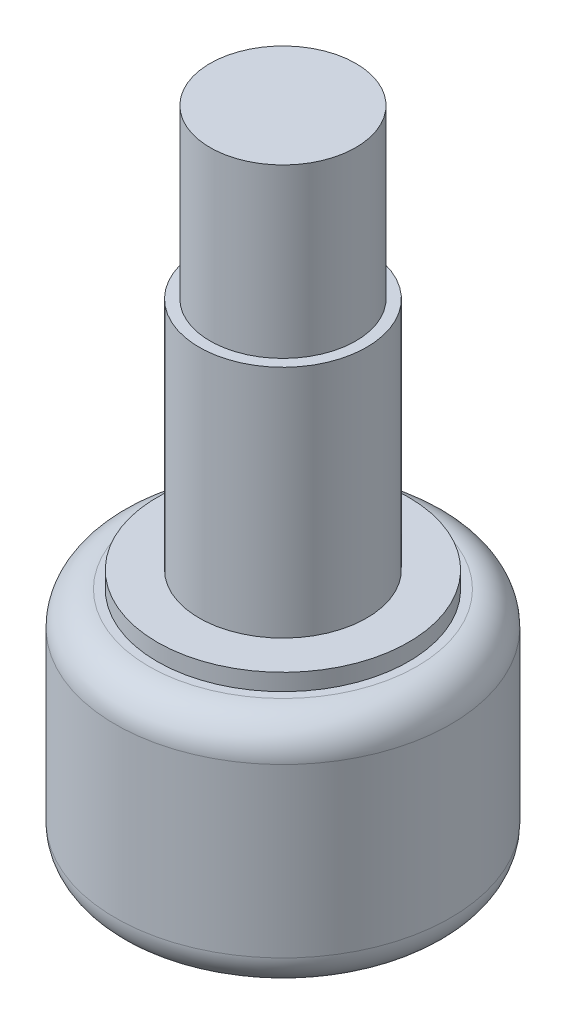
from build123d import *


with BuildPart() as part:
    # Sketch1 → Base-Revolve (revolve)
    with BuildSketch(Plane.XY, mode=Mode.PRIVATE) as base_revolve_sk:
        with BuildLine():
            Line((0, 0), (-6.35, 0))
            ThreePointArc((-6.35, 0), (-7.472532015, 0.464967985), (-7.9375, 1.5875))
            Line((-7.9375, 1.5875), (-7.9375, 9.525))
            ThreePointArc((-7.9375, 9.525), (-7.472532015, 10.647532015), (-6.35, 11.1125))
            Line((-6.35, 11.1125), (-5.953125, 11.1125))
            Line((-5.953125, 11.1125), (-5.953125, 11.90625))
            Line((-5.953125, 11.90625), (-3.96875, 11.90625))
            Line((-3.96875, 11.90625), (-3.96875, 23.01875))
            Line((-3.96875, 23.01875), (-3.4544, 23.01875))
            Line((-3.4544, 23.01875), (-3.4544, 30.95625))
            Line((-3.4544, 30.95625), (0, 30.95625))
            Line((0, 30.95625), (0, 0))
        make_face()
    revolve(base_revolve_sk.sketch.rotate(Axis((0, 0, 0), (0, 1, 0)), 270), axis=Axis((0, 0, 0), (0, 1, 0)))


solid = part.part
